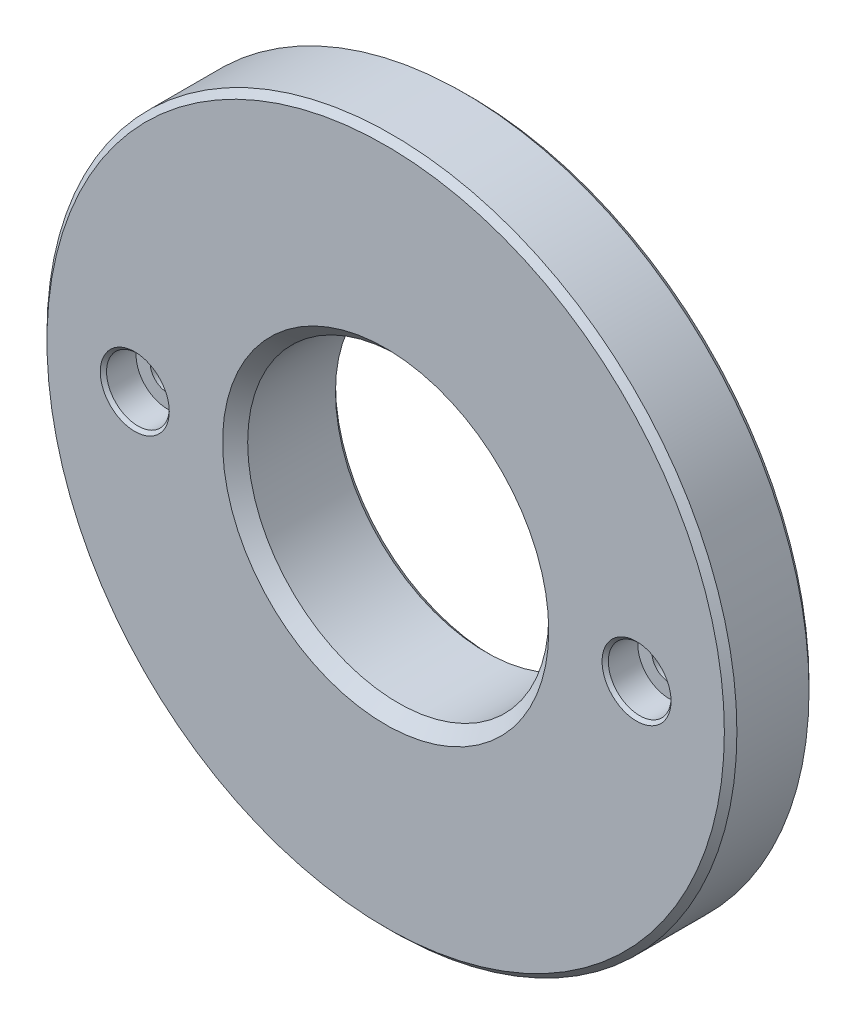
from build123d import *

# Parameters (mm, degrees)
ESQUISSE2_R             = 55
EXTRUSION1_DEPTH        = 13.5
CHANFREIN1_SIZE         = 1
CHANFREIN3_SIZE         = 1
ESQUISSE6_R             = 5
ENL_V_MAT_EXTRU_2_DEPTH = 5.2
ESQUISSE8_R             = 45
EXTRUSION2_DEPTH        = 3.5
CHANFREIN6_SIZE         = 1
ESQUISSE9_R             = 24
EXTRUSION3_DEPTH        = 20
CHANFREIN7_SIZE         = 2
CHANFREIN8_SIZE         = 1
ESQUISSE10_R            = 2.75
EXTRUSION4_DEPTH        = 80.617837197
CHANFREIN9_SIZE         = 0.5


with BuildPart() as part:
    # Esquisse2 → Extrusion1 (new body)
    with BuildSketch(Plane.XY):
        Circle(ESQUISSE2_R)
    extrude(amount=-EXTRUSION1_DEPTH)

    # Chanfrein1
    chanfrein1_edges = [part.edges().sort_by_distance(p)[0] for p in [
        (-55, 0, 0),
    ]]
    chamfer(chanfrein1_edges, length=CHANFREIN1_SIZE)

    # Chanfrein3
    chanfrein3_edges = [part.edges().sort_by_distance(p)[0] for p in [
        (-55, 0, -13.5),
    ]]
    chamfer(chanfrein3_edges, length=CHANFREIN3_SIZE)

    # Esquisse6 → Enl_v. mat.-Extru.2 (cut)
    with BuildSketch(Plane.XY):
        with Locations((-40, 0)):
            Circle(ESQUISSE6_R)
        with Locations((40, 0)):
            Circle(ESQUISSE6_R)
    extrude(amount=-ENL_V_MAT_EXTRU_2_DEPTH, mode=Mode.SUBTRACT)

    # Esquisse8 → Extrusion2 (add)
    with BuildSketch(Plane(origin=(0, 0, -13.5), x_dir=(-1, 0, 0), z_dir=(0, 0, -1))):
        with Locations(Location((0, 0, 0), (0, 0, 180))):
            Circle(ESQUISSE8_R)
    extrude(amount=EXTRUSION2_DEPTH)

    # Chanfrein6
    chanfrein6_edges = [part.edges().sort_by_distance(p)[0] for p in [
        (-45, 0, -17),
    ]]
    chamfer(chanfrein6_edges, length=CHANFREIN6_SIZE)

    # Esquisse9 → Extrusion3 (cut)
    with BuildSketch(Plane.XY):
        Circle(ESQUISSE9_R)
    extrude(amount=-EXTRUSION3_DEPTH, mode=Mode.SUBTRACT)

    # Chanfrein7
    chanfrein7_edges = [part.edges().sort_by_distance(p)[0] for p in [
        (-24, 0, 0),
    ]]
    chamfer(chanfrein7_edges, length=CHANFREIN7_SIZE)

    # Chanfrein8
    chanfrein8_edges = [part.edges().sort_by_distance(p)[0] for p in [
        (-24, 0, -17),
    ]]
    chamfer(chanfrein8_edges, length=CHANFREIN8_SIZE)

    # Esquisse10 → Extrusion4 (cut, through all)
    with BuildSketch(Plane.XY):
        with Locations((-40, 0)):
            Circle(ESQUISSE10_R)
        with Locations((40, 0)):
            Circle(ESQUISSE10_R)
    extrude(amount=-EXTRUSION4_DEPTH, mode=Mode.SUBTRACT)

    # Chanfrein9
    chanfrein9_edges = [part.edges().sort_by_distance(p)[0] for p in [
        (-45, 0, 0),
        (35, 0, 0),
    ]]
    chamfer(chanfrein9_edges, length=CHANFREIN9_SIZE)


solid = part.part
